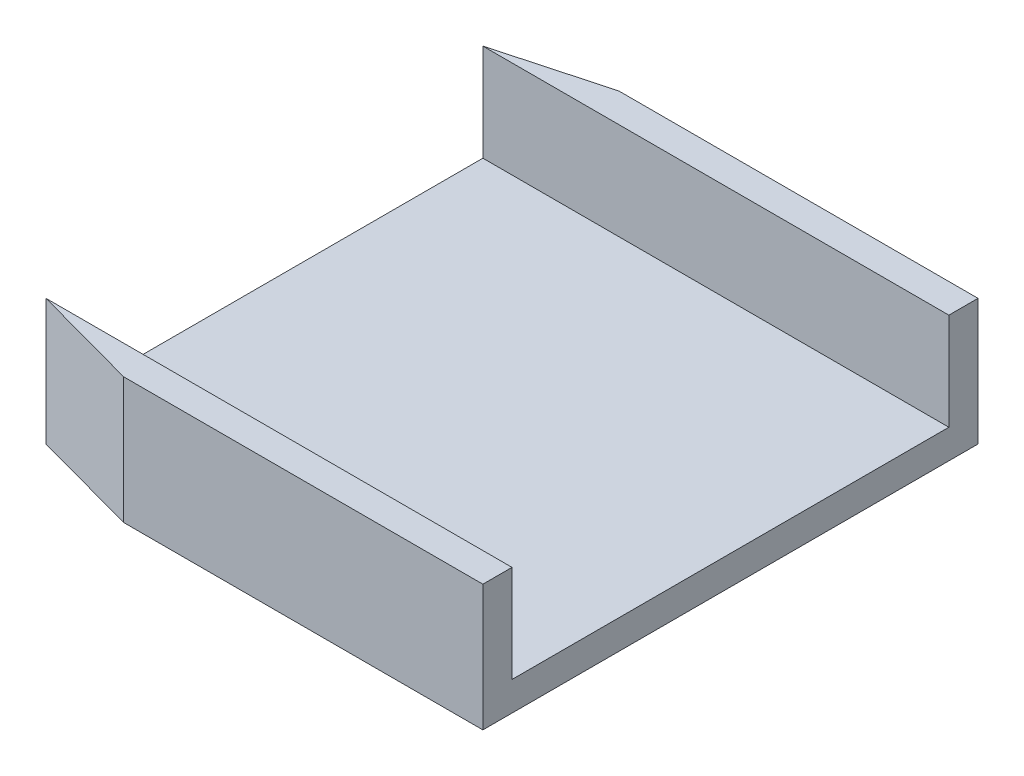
from build123d import *

# Parameters (mm, degrees)
BOSS_EXTRUDE1_DEPTH = 3
BOSS_EXTRUDE2_DEPTH = 10


with BuildPart() as part:
    # Sketch1 → Boss-Extrude1 (new body)
    with BuildSketch(Plane(origin=(0, 0, 0), x_dir=(1, 0, 0), z_dir=(0, 1, 0))):
        Polygon((0, 0), (11, -3), (48, -3), (48, 0), (48, 45), (48, 48), (11, 48), (0, 45), align=None)
    extrude(amount=BOSS_EXTRUDE1_DEPTH)

    # Sketch2 → Boss-Extrude2 (add)
    with BuildSketch(Plane(origin=(0, 3, 0), x_dir=(1, 0, 0), z_dir=(0, 1, 0))):
        Polygon((0, 0), (48, 0), (48, -3), (11, -3), align=None)
        Polygon((0, 45), (11, 48), (48, 48), (48, 45), align=None)
    extrude(amount=BOSS_EXTRUDE2_DEPTH)


solid = part.part
